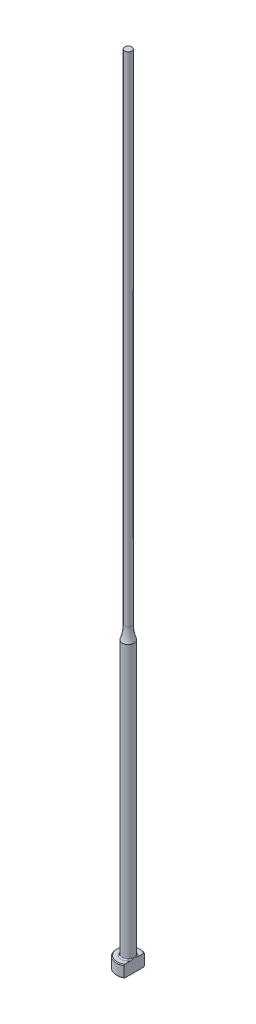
ISO-10303-21;
HEADER;
FILE_DESCRIPTION(('STEP AP214'),'2;1');
FILE_NAME('part.step','',(''),(''),'','','');
FILE_SCHEMA(('AUTOMOTIVE_DESIGN { 1 0 10303 214 1 1 1 1 }'));
ENDSEC;
DATA;
#1=APPLICATION_CONTEXT('core data for automotive mechanical design processes');
#2=APPLICATION_PROTOCOL_DEFINITION('international standard','automotive_design',2000,#1);
#3=PRODUCT_CONTEXT('',#1,'mechanical');
#4=PRODUCT('Part','Part','',(#3));
#5=PRODUCT_RELATED_PRODUCT_CATEGORY('part','',(#4));
#6=PRODUCT_DEFINITION_FORMATION('','',#4);
#7=PRODUCT_DEFINITION_CONTEXT('part definition',#1,'design');
#8=PRODUCT_DEFINITION('design','',#6,#7);
#9=PRODUCT_DEFINITION_SHAPE('','',#8);
#10=(LENGTH_UNIT() NAMED_UNIT(*) SI_UNIT(.MILLI.,.METRE.));
#11=(NAMED_UNIT(*) PLANE_ANGLE_UNIT() SI_UNIT($,.RADIAN.));
#12=(NAMED_UNIT(*) SI_UNIT($,.STERADIAN.) SOLID_ANGLE_UNIT());
#13=UNCERTAINTY_MEASURE_WITH_UNIT(LENGTH_MEASURE(1.E-05),#10,'distance_accuracy_value','');
#14=(GEOMETRIC_REPRESENTATION_CONTEXT(3) GLOBAL_UNCERTAINTY_ASSIGNED_CONTEXT((#13)) GLOBAL_UNIT_ASSIGNED_CONTEXT((#10,
#11,#12)) REPRESENTATION_CONTEXT('',''));
#15=CARTESIAN_POINT('',(0.,0.,0.));
#16=DIRECTION('',(0.,0.,1.));
#17=DIRECTION('',(1.,0.,0.));
#18=AXIS2_PLACEMENT_3D('',#15,#16,#17);
#19=CARTESIAN_POINT('',(-2.99999999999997,3.,0.));
#20=DIRECTION('',(0.,1.,0.));
#21=DIRECTION('',(0.,0.,1.));
#22=AXIS2_PLACEMENT_3D('',#19,#20,#21);
#23=PLANE('',#22);
#24=CARTESIAN_POINT('',(0.,3.,0.));
#25=DIRECTION('',(0.,1.,0.));
#26=DIRECTION('',(0.,0.,1.));
#27=AXIS2_PLACEMENT_3D('',#24,#25,#26);
#28=CIRCLE('',#27,2.79999999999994);
#29=CARTESIAN_POINT('',(1.49999999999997,3.,-2.36431808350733));
#30=VERTEX_POINT('',#29);
#31=CARTESIAN_POINT('',(1.49999999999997,3.,2.36431808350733));
#32=VERTEX_POINT('',#31);
#33=EDGE_CURVE('E187',#30,#32,#28,.T.);
#34=ORIENTED_EDGE('',*,*,#33,.T.);
#35=DIRECTION('',(0.,0.,-1.));
#36=VECTOR('',#35,1.);
#37=CARTESIAN_POINT('',(1.49999999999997,3.,0.));
#38=LINE('',#37,#36);
#39=CARTESIAN_POINT('',(1.49999999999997,3.00000000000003,0.99498743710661));
#40=VERTEX_POINT('',#39);
#41=EDGE_CURVE('E57',#32,#40,#38,.T.);
#42=ORIENTED_EDGE('',*,*,#41,.T.);
#43=CARTESIAN_POINT('',(0.,3.,0.));
#44=DIRECTION('',(0.,1.,0.));
#45=DIRECTION('',(0.,0.,1.));
#46=AXIS2_PLACEMENT_3D('',#43,#44,#45);
#47=CIRCLE('',#46,1.79999999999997);
#48=CARTESIAN_POINT('',(1.49999999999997,3.00000000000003,-0.994987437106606));
#49=VERTEX_POINT('',#48);
#50=EDGE_CURVE('E108',#40,#49,#47,.F.);
#51=ORIENTED_EDGE('',*,*,#50,.T.);
#52=EDGE_CURVE('E137',#49,#30,#38,.T.);
#53=ORIENTED_EDGE('',*,*,#52,.T.);
#54=EDGE_LOOP('',(#34,#42,#51,#53));
#55=FACE_BOUND('',#54,.T.);
#56=ADVANCED_FACE('F32',(#55),#23,.T.);
#57=CARTESIAN_POINT('',(0.,259.958771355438,0.));
#58=DIRECTION('',(0.,1.,0.));
#59=DIRECTION('',(0.,0.,1.));
#60=AXIS2_PLACEMENT_3D('',#57,#58,#59);
#61=CYLINDRICAL_SURFACE('',#60,2.99999999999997);
#62=CARTESIAN_POINT('',(0.,2.79999999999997,0.));
#63=DIRECTION('',(0.,1.,0.));
#64=DIRECTION('',(0.,0.,1.));
#65=AXIS2_PLACEMENT_3D('',#62,#63,#64);
#66=CIRCLE('',#65,2.99999999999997);
#67=CARTESIAN_POINT('',(1.49999999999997,2.79999999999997,2.5980762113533));
#68=VERTEX_POINT('',#67);
#69=CARTESIAN_POINT('',(1.49999999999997,2.79999999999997,-2.5980762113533));
#70=VERTEX_POINT('',#69);
#71=EDGE_CURVE('E105',#68,#70,#66,.F.);
#72=ORIENTED_EDGE('',*,*,#71,.T.);
#73=DIRECTION('',(0.,-1.,0.));
#74=VECTOR('',#73,1.);
#75=CARTESIAN_POINT('',(1.49999999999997,200.,-2.5980762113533));
#76=LINE('',#75,#74);
#77=CARTESIAN_POINT('',(1.49999999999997,0.200000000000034,-2.5980762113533));
#78=VERTEX_POINT('',#77);
#79=EDGE_CURVE('E193',#70,#78,#76,.T.);
#80=ORIENTED_EDGE('',*,*,#79,.T.);
#81=CARTESIAN_POINT('',(0.,0.200000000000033,0.));
#82=DIRECTION('',(0.,-1.,0.));
#83=DIRECTION('',(0.,0.,-1.));
#84=AXIS2_PLACEMENT_3D('',#81,#82,#83);
#85=CIRCLE('',#84,2.99999999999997);
#86=CARTESIAN_POINT('',(1.49999999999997,0.200000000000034,2.5980762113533));
#87=VERTEX_POINT('',#86);
#88=EDGE_CURVE('E100',#78,#87,#85,.F.);
#89=ORIENTED_EDGE('',*,*,#88,.T.);
#90=DIRECTION('',(0.,-1.,0.));
#91=VECTOR('',#90,1.);
#92=CARTESIAN_POINT('',(1.49999999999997,200.,2.5980762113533));
#93=LINE('',#92,#91);
#94=EDGE_CURVE('E93',#68,#87,#93,.T.);
#95=ORIENTED_EDGE('',*,*,#94,.F.);
#96=EDGE_LOOP('',(#72,#80,#89,#95));
#97=FACE_BOUND('',#96,.T.);
#98=ADVANCED_FACE('F158',(#97),#61,.T.);
#99=CARTESIAN_POINT('',(0.,0.,0.));
#100=DIRECTION('',(0.,-1.,0.));
#101=DIRECTION('',(0.,0.,-1.));
#102=AXIS2_PLACEMENT_3D('',#99,#100,#101);
#103=PLANE('',#102);
#104=CARTESIAN_POINT('',(0.,0.,0.));
#105=DIRECTION('',(0.,-1.,0.));
#106=DIRECTION('',(0.,0.,-1.));
#107=AXIS2_PLACEMENT_3D('',#104,#105,#106);
#108=CIRCLE('',#107,2.79999999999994);
#109=CARTESIAN_POINT('',(1.49999999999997,0.,2.36431808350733));
#110=VERTEX_POINT('',#109);
#111=CARTESIAN_POINT('',(1.49999999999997,0.,-2.36431808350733));
#112=VERTEX_POINT('',#111);
#113=EDGE_CURVE('E98',#110,#112,#108,.T.);
#114=ORIENTED_EDGE('',*,*,#113,.T.);
#115=DIRECTION('',(0.,0.,1.));
#116=VECTOR('',#115,1.);
#117=CARTESIAN_POINT('',(1.49999999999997,0.,-2.5980762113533));
#118=LINE('',#117,#116);
#119=EDGE_CURVE('E83',#112,#110,#118,.T.);
#120=ORIENTED_EDGE('',*,*,#119,.T.);
#121=EDGE_LOOP('',(#114,#120));
#122=FACE_BOUND('',#121,.T.);
#123=ADVANCED_FACE('F103',(#122),#103,.T.);
#124=CARTESIAN_POINT('',(0.,3.,0.));
#125=DIRECTION('',(0.,-1.,0.));
#126=DIRECTION('',(0.,0.,-1.));
#127=AXIS2_PLACEMENT_3D('',#124,#125,#126);
#128=CONICAL_SURFACE('',#127,2.79999999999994,0.785398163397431);
#129=ORIENTED_EDGE('',*,*,#71,.F.);
#130=CARTESIAN_POINT('',(1.49999999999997,-0.11174109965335,5.71827621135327));
#131=CARTESIAN_POINT('',(1.49999999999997,0.0136183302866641,5.58866816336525));
#132=CARTESIAN_POINT('',(1.49999999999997,0.138843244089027,5.45892957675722));
#133=CARTESIAN_POINT('',(1.49999999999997,0.388944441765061,5.19911365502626));
#134=CARTESIAN_POINT('',(1.49999999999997,0.513820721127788,5.06903631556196));
#135=CARTESIAN_POINT('',(1.49999999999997,0.763205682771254,4.80840180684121));
#136=CARTESIAN_POINT('',(1.49999999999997,0.887714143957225,4.67784442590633));
#137=CARTESIAN_POINT('',(1.49999999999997,1.13618059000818,4.4162081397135));
#138=CARTESIAN_POINT('',(1.49999999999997,1.26013857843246,4.28512923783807));
#139=CARTESIAN_POINT('',(1.49999999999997,1.50488975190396,4.02490837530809));
#140=CARTESIAN_POINT('',(1.49999999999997,1.62569693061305,3.8957795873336));
#141=CARTESIAN_POINT('',(1.49999999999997,1.86640694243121,3.63668213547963));
#142=CARTESIAN_POINT('',(1.49999999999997,1.98630978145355,3.50671347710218));
#143=CARTESIAN_POINT('',(1.49999999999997,2.2248603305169,3.24567921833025));
#144=CARTESIAN_POINT('',(1.49999999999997,2.3435083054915,3.11461386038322));
#145=CARTESIAN_POINT('',(1.49999999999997,2.5790771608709,2.85094268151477));
#146=CARTESIAN_POINT('',(1.49999999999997,2.69599811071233,2.71833692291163));
#147=CARTESIAN_POINT('',(1.49999999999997,2.88262371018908,2.50255231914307));
#148=CARTESIAN_POINT('',(1.49999999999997,2.95312454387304,2.42006293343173));
#149=CARTESIAN_POINT('',(1.49999999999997,3.09287098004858,2.25401084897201));
#150=CARTESIAN_POINT('',(1.49999999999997,3.16211645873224,2.17044804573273));
#151=CARTESIAN_POINT('',(1.49999999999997,3.29964684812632,2.00105967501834));
#152=CARTESIAN_POINT('',(1.49999999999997,3.36791386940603,1.9152195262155));
#153=CARTESIAN_POINT('',(1.49999999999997,3.50205840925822,1.7417139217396));
#154=CARTESIAN_POINT('',(1.49999999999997,3.56793649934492,1.65404891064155));
#155=CARTESIAN_POINT('',(1.49999999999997,3.69728151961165,1.47490236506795));
#156=CARTESIAN_POINT('',(1.49999999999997,3.76069661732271,1.38338308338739));
#157=CARTESIAN_POINT('',(1.49999999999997,3.88239539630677,1.19675661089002));
#158=CARTESIAN_POINT('',(1.49999999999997,3.94067201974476,1.10164473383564));
#159=CARTESIAN_POINT('',(1.49999999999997,4.048413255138,0.908008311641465));
#160=CARTESIAN_POINT('',(1.49999999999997,4.09797809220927,0.809540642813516));
#161=CARTESIAN_POINT('',(1.49999999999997,4.18432188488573,0.60719295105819));
#162=CARTESIAN_POINT('',(1.49999999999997,4.22114374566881,0.503332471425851));
#163=CARTESIAN_POINT('',(1.49999999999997,4.26099935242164,0.3475775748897));
#164=CARTESIAN_POINT('',(1.49999999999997,4.2715702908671,0.297609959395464));
#165=CARTESIAN_POINT('',(1.49999999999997,4.28794860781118,0.196885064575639));
#166=CARTESIAN_POINT('',(1.49999999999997,4.29375640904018,0.146127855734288));
#167=CARTESIAN_POINT('',(1.49999999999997,4.30019707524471,0.0444388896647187));
#168=CARTESIAN_POINT('',(1.49999999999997,4.30084594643,-0.00649183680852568));
#169=CARTESIAN_POINT('',(1.49999999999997,4.29696416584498,-0.108155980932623));
#170=CARTESIAN_POINT('',(1.49999999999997,4.29243308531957,-0.158889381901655));
#171=CARTESIAN_POINT('',(1.49999999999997,4.27856915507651,-0.259234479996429));
#172=CARTESIAN_POINT('',(1.49999999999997,4.2692782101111,-0.308852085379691));
#173=CARTESIAN_POINT('',(1.49999999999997,4.24647108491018,-0.407110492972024));
#174=CARTESIAN_POINT('',(1.49999999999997,4.23295324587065,-0.45575090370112));
#175=CARTESIAN_POINT('',(1.49999999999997,4.20226175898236,-0.55214996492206));
#176=CARTESIAN_POINT('',(1.49999999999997,4.18506801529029,-0.599902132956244));
#177=CARTESIAN_POINT('',(1.49999999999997,4.14771387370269,-0.694205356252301));
#178=CARTESIAN_POINT('',(1.49999999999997,4.12755408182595,-0.740756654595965));
#179=CARTESIAN_POINT('',(1.49999999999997,4.0632769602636,-0.879166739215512));
#180=CARTESIAN_POINT('',(1.49999999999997,4.01551721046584,-0.969329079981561));
#181=CARTESIAN_POINT('',(1.49999999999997,3.91367909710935,-1.14604316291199));
#182=CARTESIAN_POINT('',(1.49999999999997,3.85959300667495,-1.2325903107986));
#183=CARTESIAN_POINT('',(1.49999999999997,3.74697968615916,-1.40321348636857));
#184=CARTESIAN_POINT('',(1.49999999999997,3.68843573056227,-1.4872783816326));
#185=CARTESIAN_POINT('',(1.49999999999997,3.5684384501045,-1.65322187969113));
#186=CARTESIAN_POINT('',(1.49999999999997,3.50698656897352,-1.73510153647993));
#187=CARTESIAN_POINT('',(1.49999999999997,3.3811567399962,-1.89829823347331));
#188=CARTESIAN_POINT('',(1.49999999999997,3.31675092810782,-1.97959369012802));
#189=CARTESIAN_POINT('',(1.49999999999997,3.18634068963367,-2.14090082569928));
#190=CARTESIAN_POINT('',(1.49999999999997,3.12033609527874,-2.22091236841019));
#191=CARTESIAN_POINT('',(1.49999999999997,2.92086431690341,-2.45906508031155));
#192=CARTESIAN_POINT('',(1.49999999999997,2.78562663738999,-2.61572090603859));
#193=CARTESIAN_POINT('',(1.49999999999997,2.53554498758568,-2.90006295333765));
#194=CARTESIAN_POINT('',(1.49999999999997,2.42114543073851,-3.02814382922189));
#195=CARTESIAN_POINT('',(1.49999999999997,2.1909355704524,-3.28303767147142));
#196=CARTESIAN_POINT('',(1.49999999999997,2.07512522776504,-3.40985060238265));
#197=CARTESIAN_POINT('',(1.49999999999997,1.72597067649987,-3.78913849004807));
#198=CARTESIAN_POINT('',(1.49999999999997,1.49111760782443,-4.04022177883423));
#199=CARTESIAN_POINT('',(1.49999999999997,1.0288247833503,-4.52992803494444));
#200=CARTESIAN_POINT('',(1.49999999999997,0.801477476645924,-4.76863870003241));
#201=CARTESIAN_POINT('',(1.49999999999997,0.459548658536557,-5.12558036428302));
#202=CARTESIAN_POINT('',(1.49999999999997,0.345484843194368,-5.24430773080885));
#203=CARTESIAN_POINT('',(1.49999999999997,0.117071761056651,-5.48148573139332));
#204=CARTESIAN_POINT('',(1.49999999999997,0.00272249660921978,-5.59993636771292));
#205=CARTESIAN_POINT('',(1.49999999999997,-0.11174109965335,-5.71827621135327));
#206=B_SPLINE_CURVE_WITH_KNOTS('',3,(#130,#131,#132,#133,#134,#135,#136,#137,#138,#139,#140,
#141,#142,#143,#144,#145,#146,#147,#148,#149,#150,#151,#152,#153,#154,#155,#156,#157,#158,#159,
#160,#161,#162,#163,#164,#165,#166,#167,#168,#169,#170,#171,#172,#173,#174,#175,#176,#177,#178,
#179,#180,#181,#182,#183,#184,#185,#186,#187,#188,#189,#190,#191,#192,#193,#194,#195,#196,#197,
#198,#199,#200,#201,#202,#203,#204,#205),.UNSPECIFIED.,.F.,.F.,(4,2,2,2,2,2,2,2,2,2,2,2,2,2,2,2,
2,2,2,2,2,2,2,2,2,2,2,2,2,2,2,2,2,2,2,2,2,4),(0.,0.540943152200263,1.08189327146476,
1.62312052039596,2.16434426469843,2.69482920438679,3.22531067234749,3.75567781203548,
4.28602356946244,4.61155053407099,4.9371094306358,5.26610945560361,5.59503024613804,
5.92894782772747,6.26331713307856,6.59354403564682,6.92264800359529,7.07567478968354,
7.2286879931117,7.38122626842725,7.53377717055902,7.6850075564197,7.83629736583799,
7.98843643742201,8.14054446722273,8.44618799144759,8.75220879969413,9.05944044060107,
9.3665211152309,9.6776428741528,9.98879742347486,10.609592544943,11.1247803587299,
11.6399825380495,12.6713544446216,13.6603005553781,14.1542238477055,14.6481430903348),.UNSPECIFIED.);
#207=EDGE_CURVE('E136',#68,#32,#206,.T.);
#208=ORIENTED_EDGE('',*,*,#207,.T.);
#209=ORIENTED_EDGE('',*,*,#33,.F.);
#210=EDGE_CURVE('E128',#30,#70,#206,.T.);
#211=ORIENTED_EDGE('',*,*,#210,.T.);
#212=EDGE_LOOP('',(#129,#208,#209,#211));
#213=FACE_BOUND('',#212,.T.);
#214=ADVANCED_FACE('F144',(#213),#128,.T.);
#215=CARTESIAN_POINT('',(0.,0.200000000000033,0.));
#216=DIRECTION('',(0.,1.,0.));
#217=DIRECTION('',(0.,0.,1.));
#218=AXIS2_PLACEMENT_3D('',#215,#216,#217);
#219=CONICAL_SURFACE('',#218,2.99999999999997,0.785398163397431);
#220=ORIENTED_EDGE('',*,*,#88,.F.);
#221=CARTESIAN_POINT('',(1.49999999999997,3.11174109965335,-5.71827621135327));
#222=CARTESIAN_POINT('',(1.49999999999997,2.98638166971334,-5.58866816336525));
#223=CARTESIAN_POINT('',(1.49999999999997,2.86115675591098,-5.45892957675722));
#224=CARTESIAN_POINT('',(1.49999999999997,2.61105555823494,-5.19911365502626));
#225=CARTESIAN_POINT('',(1.49999999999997,2.48617927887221,-5.06903631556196));
#226=CARTESIAN_POINT('',(1.49999999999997,2.23679431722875,-4.80840180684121));
#227=CARTESIAN_POINT('',(1.49999999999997,2.11228585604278,-4.67784442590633));
#228=CARTESIAN_POINT('',(1.49999999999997,1.86381940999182,-4.4162081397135));
#229=CARTESIAN_POINT('',(1.49999999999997,1.73986142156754,-4.28512923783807));
#230=CARTESIAN_POINT('',(1.49999999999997,1.49511024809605,-4.02490837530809));
#231=CARTESIAN_POINT('',(1.49999999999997,1.37430306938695,-3.8957795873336));
#232=CARTESIAN_POINT('',(1.49999999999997,1.13359305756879,-3.63668213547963));
#233=CARTESIAN_POINT('',(1.49999999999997,1.01369021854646,-3.50671347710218));
#234=CARTESIAN_POINT('',(1.49999999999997,0.775139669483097,-3.24567921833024));
#235=CARTESIAN_POINT('',(1.49999999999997,0.656491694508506,-3.11461386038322));
#236=CARTESIAN_POINT('',(1.49999999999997,0.420922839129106,-2.85094268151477));
#237=CARTESIAN_POINT('',(1.49999999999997,0.304001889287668,-2.71833692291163));
#238=CARTESIAN_POINT('',(1.49999999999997,0.117376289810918,-2.50255231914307));
#239=CARTESIAN_POINT('',(1.49999999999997,0.0468754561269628,-2.42006293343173));
#240=CARTESIAN_POINT('',(1.49999999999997,-0.0928709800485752,-2.254010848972));
#241=CARTESIAN_POINT('',(1.49999999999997,-0.162116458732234,-2.17044804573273));
#242=CARTESIAN_POINT('',(1.49999999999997,-0.299646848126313,-2.00105967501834));
#243=CARTESIAN_POINT('',(1.49999999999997,-0.367913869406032,-1.9152195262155));
#244=CARTESIAN_POINT('',(1.49999999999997,-0.502058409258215,-1.7417139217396));
#245=CARTESIAN_POINT('',(1.49999999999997,-0.567936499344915,-1.65404891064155));
#246=CARTESIAN_POINT('',(1.49999999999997,-0.697281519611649,-1.47490236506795));
#247=CARTESIAN_POINT('',(1.49999999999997,-0.760696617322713,-1.38338308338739));
#248=CARTESIAN_POINT('',(1.49999999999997,-0.882395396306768,-1.19675661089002));
#249=CARTESIAN_POINT('',(1.49999999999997,-0.940672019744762,-1.10164473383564));
#250=CARTESIAN_POINT('',(1.49999999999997,-1.04841325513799,-0.908008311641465));
#251=CARTESIAN_POINT('',(1.49999999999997,-1.09797809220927,-0.809540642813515));
#252=CARTESIAN_POINT('',(1.49999999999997,-1.18432188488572,-0.607192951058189));
#253=CARTESIAN_POINT('',(1.49999999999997,-1.22114374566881,-0.503332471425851));
#254=CARTESIAN_POINT('',(1.49999999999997,-1.26099935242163,-0.3475775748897));
#255=CARTESIAN_POINT('',(1.49999999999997,-1.2715702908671,-0.297609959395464));
#256=CARTESIAN_POINT('',(1.49999999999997,-1.28794860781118,-0.19688506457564));
#257=CARTESIAN_POINT('',(1.49999999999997,-1.29375640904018,-0.146127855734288));
#258=CARTESIAN_POINT('',(1.49999999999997,-1.30019707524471,-0.0444388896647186));
#259=CARTESIAN_POINT('',(1.49999999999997,-1.30084594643,0.00649183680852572));
#260=CARTESIAN_POINT('',(1.49999999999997,-1.29696416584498,0.108155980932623));
#261=CARTESIAN_POINT('',(1.49999999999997,-1.29243308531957,0.158889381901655));
#262=CARTESIAN_POINT('',(1.49999999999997,-1.2785691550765,0.259234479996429));
#263=CARTESIAN_POINT('',(1.49999999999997,-1.2692782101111,0.308852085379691));
#264=CARTESIAN_POINT('',(1.49999999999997,-1.24647108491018,0.407110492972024));
#265=CARTESIAN_POINT('',(1.49999999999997,-1.23295324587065,0.45575090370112));
#266=CARTESIAN_POINT('',(1.49999999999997,-1.20226175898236,0.55214996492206));
#267=CARTESIAN_POINT('',(1.49999999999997,-1.18506801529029,0.599902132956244));
#268=CARTESIAN_POINT('',(1.49999999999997,-1.14771387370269,0.694205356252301));
#269=CARTESIAN_POINT('',(1.49999999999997,-1.12755408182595,0.740756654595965));
#270=CARTESIAN_POINT('',(1.49999999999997,-1.0632769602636,0.879166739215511));
#271=CARTESIAN_POINT('',(1.49999999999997,-1.01551721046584,0.96932907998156));
#272=CARTESIAN_POINT('',(1.49999999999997,-0.913679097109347,1.14604316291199));
#273=CARTESIAN_POINT('',(1.49999999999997,-0.85959300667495,1.2325903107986));
#274=CARTESIAN_POINT('',(1.49999999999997,-0.74697968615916,1.40321348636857));
#275=CARTESIAN_POINT('',(1.49999999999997,-0.688435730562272,1.4872783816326));
#276=CARTESIAN_POINT('',(1.49999999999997,-0.568438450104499,1.65322187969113));
#277=CARTESIAN_POINT('',(1.49999999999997,-0.50698656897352,1.73510153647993));
#278=CARTESIAN_POINT('',(1.49999999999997,-0.381156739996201,1.89829823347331));
#279=CARTESIAN_POINT('',(1.49999999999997,-0.316750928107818,1.97959369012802));
#280=CARTESIAN_POINT('',(1.49999999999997,-0.186340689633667,2.14090082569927));
#281=CARTESIAN_POINT('',(1.49999999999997,-0.120336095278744,2.22091236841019));
#282=CARTESIAN_POINT('',(1.49999999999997,0.0791356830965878,2.45906508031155));
#283=CARTESIAN_POINT('',(1.49999999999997,0.214373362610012,2.61572090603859));
#284=CARTESIAN_POINT('',(1.49999999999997,0.464455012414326,2.90006295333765));
#285=CARTESIAN_POINT('',(1.49999999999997,0.578854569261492,3.02814382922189));
#286=CARTESIAN_POINT('',(1.49999999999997,0.809064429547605,3.28303767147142));
#287=CARTESIAN_POINT('',(1.49999999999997,0.924874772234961,3.40985060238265));
#288=CARTESIAN_POINT('',(1.49999999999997,1.27402932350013,3.78913849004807));
#289=CARTESIAN_POINT('',(1.49999999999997,1.50888239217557,4.04022177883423));
#290=CARTESIAN_POINT('',(1.49999999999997,1.97117521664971,4.52992803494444));
#291=CARTESIAN_POINT('',(1.49999999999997,2.19852252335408,4.76863870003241));
#292=CARTESIAN_POINT('',(1.49999999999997,2.54045134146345,5.12558036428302));
#293=CARTESIAN_POINT('',(1.49999999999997,2.65451515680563,5.24430773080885));
#294=CARTESIAN_POINT('',(1.49999999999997,2.88292823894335,5.48148573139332));
#295=CARTESIAN_POINT('',(1.49999999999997,2.99727750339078,5.59993636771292));
#296=CARTESIAN_POINT('',(1.49999999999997,3.11174109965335,5.71827621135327));
#297=B_SPLINE_CURVE_WITH_KNOTS('',3,(#221,#222,#223,#224,#225,#226,#227,#228,#229,#230,#231,
#232,#233,#234,#235,#236,#237,#238,#239,#240,#241,#242,#243,#244,#245,#246,#247,#248,#249,#250,
#251,#252,#253,#254,#255,#256,#257,#258,#259,#260,#261,#262,#263,#264,#265,#266,#267,#268,#269,
#270,#271,#272,#273,#274,#275,#276,#277,#278,#279,#280,#281,#282,#283,#284,#285,#286,#287,#288,
#289,#290,#291,#292,#293,#294,#295,#296),.UNSPECIFIED.,.F.,.F.,(4,2,2,2,2,2,2,2,2,2,2,2,2,2,2,2,
2,2,2,2,2,2,2,2,2,2,2,2,2,2,2,2,2,2,2,2,2,4),(0.,0.540943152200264,1.08189327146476,
1.62312052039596,2.16434426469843,2.69482920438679,3.22531067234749,3.75567781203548,
4.28602356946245,4.611550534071,4.9371094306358,5.26610945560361,5.59503024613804,
5.92894782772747,6.26331713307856,6.59354403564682,6.92264800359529,7.07567478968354,
7.2286879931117,7.38122626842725,7.53377717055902,7.6850075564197,7.83629736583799,
7.98843643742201,8.14054446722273,8.44618799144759,8.75220879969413,9.05944044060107,
9.3665211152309,9.6776428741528,9.98879742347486,10.609592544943,11.1247803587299,
11.6399825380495,12.6713544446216,13.6603005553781,14.1542238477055,14.6481430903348),.UNSPECIFIED.);
#298=EDGE_CURVE('E86',#78,#112,#297,.T.);
#299=ORIENTED_EDGE('',*,*,#298,.T.);
#300=ORIENTED_EDGE('',*,*,#113,.F.);
#301=EDGE_CURVE('E89',#110,#87,#297,.T.);
#302=ORIENTED_EDGE('',*,*,#301,.T.);
#303=EDGE_LOOP('',(#220,#299,#300,#302));
#304=FACE_BOUND('',#303,.T.);
#305=ADVANCED_FACE('F97',(#304),#219,.T.);
#306=CARTESIAN_POINT('',(0.,3.30000000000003,0.));
#307=DIRECTION('',(0.,1.,0.));
#308=DIRECTION('',(0.,0.,1.));
#309=AXIS2_PLACEMENT_3D('',#306,#307,#308);
#310=TOROIDAL_SURFACE('',#309,1.79999999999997,0.3);
#311=CARTESIAN_POINT('',(1.49999999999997,3.30000000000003,0.));
#312=CARTESIAN_POINT('',(1.49999999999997,3.300000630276,3.41555678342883E-12));
#313=CARTESIAN_POINT('',(1.49999999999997,3.30000126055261,-1.15373640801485E-07));
#314=CARTESIAN_POINT('',(1.49999999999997,3.3000024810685,-4.90631575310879E-07));
#315=CARTESIAN_POINT('',(1.49999999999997,3.30000307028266,-7.53296670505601E-07));
#316=CARTESIAN_POINT('',(1.49999999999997,3.30000424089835,-1.38757096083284E-06));
#317=CARTESIAN_POINT('',(1.49999999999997,3.300004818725,-1.76563001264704E-06));
#318=CARTESIAN_POINT('',(1.49999999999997,3.30000591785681,-2.58768006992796E-06));
#319=CARTESIAN_POINT('',(1.49999999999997,3.30000643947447,-3.03127014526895E-06));
#320=CARTESIAN_POINT('',(1.49999999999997,3.30000815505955,-4.60021967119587E-06));
#321=CARTESIAN_POINT('',(1.49999999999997,3.30000927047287,-5.8124152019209E-06));
#322=CARTESIAN_POINT('',(1.49999999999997,3.30001128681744,-8.33989413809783E-06));
#323=CARTESIAN_POINT('',(1.49999999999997,3.30001219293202,-9.65128157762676E-06));
#324=CARTESIAN_POINT('',(1.49999999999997,3.30001551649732,-1.46782505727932E-05));
#325=CARTESIAN_POINT('',(1.49999999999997,3.30001775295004,-1.8517976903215E-05));
#326=CARTESIAN_POINT('',(1.49999999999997,3.30002148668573,-2.61616194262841E-05));
#327=CARTESIAN_POINT('',(1.49999999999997,3.30002302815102,-2.99447742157E-05));
#328=CARTESIAN_POINT('',(1.49999999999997,3.30002943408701,-4.58003743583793E-05));
#329=CARTESIAN_POINT('',(1.49999999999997,3.3000341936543,-5.79079078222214E-05));
#330=CARTESIAN_POINT('',(1.49999999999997,3.30004197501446,-8.07263755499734E-05));
#331=CARTESIAN_POINT('',(1.49999999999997,3.30004514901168,-9.13834709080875E-05));
#332=CARTESIAN_POINT('',(1.49999999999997,3.30006989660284,-0.000167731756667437));
#333=CARTESIAN_POINT('',(1.49999999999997,3.30010092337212,-0.000229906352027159));
#334=CARTESIAN_POINT('',(1.49999999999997,3.30021632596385,-0.000470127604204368));
#335=CARTESIAN_POINT('',(1.49999999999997,3.30029368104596,-0.000650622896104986));
#336=CARTESIAN_POINT('',(1.49999999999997,3.30059619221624,-0.00134589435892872));
#337=CARTESIAN_POINT('',(1.49999999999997,3.30082870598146,-0.00185814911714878));
#338=CARTESIAN_POINT('',(1.49999999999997,3.30176696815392,-0.00393547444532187));
#339=CARTESIAN_POINT('',(1.49999999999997,3.30246445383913,-0.00550332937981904));
#340=CARTESIAN_POINT('',(1.49999999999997,3.31426785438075,-0.0320229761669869));
#341=CARTESIAN_POINT('',(1.49999999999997,3.32544800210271,-0.0569503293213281));
#342=CARTESIAN_POINT('',(1.49999999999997,3.34725700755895,-0.105984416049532));
#343=CARTESIAN_POINT('',(1.49999999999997,3.35789134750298,-0.130088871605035));
#344=CARTESIAN_POINT('',(1.49999999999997,3.38015321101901,-0.181096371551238));
#345=CARTESIAN_POINT('',(1.49999999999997,3.39175804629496,-0.208009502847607));
#346=CARTESIAN_POINT('',(1.49999999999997,3.41469034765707,-0.262264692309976));
#347=CARTESIAN_POINT('',(1.49999999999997,3.42601398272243,-0.289608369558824));
#348=CARTESIAN_POINT('',(1.49999999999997,3.45363212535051,-0.35820378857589));
#349=CARTESIAN_POINT('',(1.49999999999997,3.46959026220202,-0.39959288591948));
#350=CARTESIAN_POINT('',(1.49999999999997,3.49940505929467,-0.482097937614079));
#351=CARTESIAN_POINT('',(1.49999999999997,3.51330033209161,-0.523199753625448));
#352=CARTESIAN_POINT('',(1.49999999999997,3.53552507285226,-0.595497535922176));
#353=CARTESIAN_POINT('',(1.49999999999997,3.54436834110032,-0.626532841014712));
#354=CARTESIAN_POINT('',(1.49999999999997,3.56052427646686,-0.6891760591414));
#355=CARTESIAN_POINT('',(1.49999999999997,3.5678279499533,-0.720786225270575));
#356=CARTESIAN_POINT('',(1.49999999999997,3.5875075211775,-0.819524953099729));
#357=CARTESIAN_POINT('',(1.49999999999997,3.59661044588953,-0.88742909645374));
#358=CARTESIAN_POINT('',(1.49999999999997,3.60059842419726,-0.991180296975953));
#359=CARTESIAN_POINT('',(1.49999999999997,3.60019840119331,-1.02684364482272));
#360=CARTESIAN_POINT('',(1.49999999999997,3.59497085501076,-1.097505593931));
#361=CARTESIAN_POINT('',(1.49999999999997,3.59019295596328,-1.13250716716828));
#362=CARTESIAN_POINT('',(1.49999999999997,3.57687734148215,-1.19353096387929));
#363=CARTESIAN_POINT('',(1.49999999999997,3.56943875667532,-1.21978854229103));
#364=CARTESIAN_POINT('',(1.49999999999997,3.55063748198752,-1.27094658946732));
#365=CARTESIAN_POINT('',(1.49999999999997,3.53927342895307,-1.29584658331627));
#366=CARTESIAN_POINT('',(1.49999999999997,3.51660016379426,-1.33501873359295));
#367=CARTESIAN_POINT('',(1.49999999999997,3.50657738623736,-1.35003296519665));
#368=CARTESIAN_POINT('',(1.49999999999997,3.48437469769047,-1.37837252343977));
#369=CARTESIAN_POINT('',(1.49999999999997,3.47219867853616,-1.39170082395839));
#370=CARTESIAN_POINT('',(1.49999999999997,3.44835614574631,-1.41349417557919));
#371=CARTESIAN_POINT('',(1.49999999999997,3.43709185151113,-1.42239673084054));
#372=CARTESIAN_POINT('',(1.49999999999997,3.41325256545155,-1.43825467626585));
#373=CARTESIAN_POINT('',(1.49999999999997,3.40067804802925,-1.44521076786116));
#374=CARTESIAN_POINT('',(1.49999999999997,3.37433767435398,-1.45677158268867));
#375=CARTESIAN_POINT('',(1.49999999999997,3.36056203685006,-1.46135438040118));
#376=CARTESIAN_POINT('',(1.49999999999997,3.33237324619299,-1.46767730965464));
#377=CARTESIAN_POINT('',(1.49999999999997,3.31796076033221,-1.46942034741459));
#378=CARTESIAN_POINT('',(1.49999999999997,3.29122479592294,-1.4698720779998));
#379=CARTESIAN_POINT('',(1.49999999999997,3.27890664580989,-1.468990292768));
#380=CARTESIAN_POINT('',(1.49999999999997,3.25461019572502,-1.4651157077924));
#381=CARTESIAN_POINT('',(1.49999999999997,3.2426318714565,-1.46212305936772));
#382=CARTESIAN_POINT('',(1.49999999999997,3.21959683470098,-1.4543117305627));
#383=CARTESIAN_POINT('',(1.49999999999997,3.20852542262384,-1.44953579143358));
#384=CARTESIAN_POINT('',(1.49999999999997,3.18721125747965,-1.43840957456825));
#385=CARTESIAN_POINT('',(1.49999999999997,3.1769687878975,-1.43205876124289));
#386=CARTESIAN_POINT('',(1.49999999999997,3.15325976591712,-1.41506353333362));
#387=CARTESIAN_POINT('',(1.49999999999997,3.14027750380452,-1.40374235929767));
#388=CARTESIAN_POINT('',(1.49999999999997,3.11630720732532,-1.37914825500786));
#389=CARTESIAN_POINT('',(1.49999999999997,3.10532420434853,-1.36587054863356));
#390=CARTESIAN_POINT('',(1.49999999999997,3.08100891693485,-1.33197272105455));
#391=CARTESIAN_POINT('',(1.49999999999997,3.06867625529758,-1.31063843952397));
#392=CARTESIAN_POINT('',(1.49999999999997,3.04751867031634,-1.26637455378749));
#393=CARTESIAN_POINT('',(1.49999999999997,3.03869240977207,-1.24344556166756));
#394=CARTESIAN_POINT('',(1.49999999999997,3.01978360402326,-1.18316534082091));
#395=CARTESIAN_POINT('',(1.49999999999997,3.01191472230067,-1.14512623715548));
#396=CARTESIAN_POINT('',(1.49999999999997,3.00188285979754,-1.06789971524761));
#397=CARTESIAN_POINT('',(1.49999999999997,2.99979735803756,-1.02870374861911));
#398=CARTESIAN_POINT('',(1.49999999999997,3.00021727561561,-0.953160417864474));
#399=CARTESIAN_POINT('',(1.49999999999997,3.00240673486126,-0.916808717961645));
#400=CARTESIAN_POINT('',(1.49999999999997,3.0099643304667,-0.844432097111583));
#401=CARTESIAN_POINT('',(1.49999999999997,3.01533462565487,-0.808407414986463));
#402=CARTESIAN_POINT('',(1.49999999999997,3.02828086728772,-0.738670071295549));
#403=CARTESIAN_POINT('',(1.49999999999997,3.03573028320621,-0.704933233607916));
#404=CARTESIAN_POINT('',(1.49999999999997,3.05243174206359,-0.638128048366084));
#405=CARTESIAN_POINT('',(1.49999999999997,3.06167285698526,-0.605056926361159));
#406=CARTESIAN_POINT('',(1.49999999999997,3.08440652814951,-0.53019513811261));
#407=CARTESIAN_POINT('',(1.49999999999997,3.09836576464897,-0.488547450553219));
#408=CARTESIAN_POINT('',(1.49999999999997,3.1283820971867,-0.404954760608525));
#409=CARTESIAN_POINT('',(1.49999999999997,3.14447968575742,-0.363024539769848));
#410=CARTESIAN_POINT('',(1.49999999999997,3.17238454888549,-0.293508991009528));
#411=CARTESIAN_POINT('',(1.49999999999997,3.18384249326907,-0.265781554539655));
#412=CARTESIAN_POINT('',(1.49999999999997,3.20705854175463,-0.210769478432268));
#413=CARTESIAN_POINT('',(1.49999999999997,3.21881265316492,-0.183483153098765));
#414=CARTESIAN_POINT('',(1.49999999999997,3.24136702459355,-0.131772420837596));
#415=CARTESIAN_POINT('',(1.49999999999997,3.25214361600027,-0.107337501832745));
#416=CARTESIAN_POINT('',(1.49999999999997,3.27424746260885,-0.0576321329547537));
#417=CARTESIAN_POINT('',(1.49999999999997,3.28558038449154,-0.0323640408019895));
#418=CARTESIAN_POINT('',(1.49999999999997,3.29753556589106,-0.00550327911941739));
#419=CARTESIAN_POINT('',(1.49999999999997,3.29823307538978,-0.00393537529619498));
#420=CARTESIAN_POINT('',(1.49999999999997,3.29917134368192,-0.00185803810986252));
#421=CARTESIAN_POINT('',(1.49999999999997,3.29940384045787,-0.00134582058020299));
#422=CARTESIAN_POINT('',(1.49999999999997,3.29970633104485,-0.000650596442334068));
#423=CARTESIAN_POINT('',(1.49999999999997,3.29978368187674,-0.000470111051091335));
#424=CARTESIAN_POINT('',(1.49999999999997,3.29989907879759,-0.000229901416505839));
#425=CARTESIAN_POINT('',(1.49999999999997,3.29993010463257,-0.000167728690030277));
#426=CARTESIAN_POINT('',(1.49999999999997,3.29995485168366,-9.13825689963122E-05));
#427=CARTESIAN_POINT('',(1.49999999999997,3.29995802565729,-8.07256241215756E-05));
#428=CARTESIAN_POINT('',(1.49999999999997,3.29996580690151,-5.79074820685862E-05));
#429=CARTESIAN_POINT('',(1.49999999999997,3.29997056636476,-4.5800119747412E-05));
#430=CARTESIAN_POINT('',(1.49999999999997,3.29997697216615,-2.99447119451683E-05));
#431=CARTESIAN_POINT('',(1.49999999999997,3.2999785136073,-2.61615817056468E-05));
#432=CARTESIAN_POINT('',(1.49999999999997,3.2999822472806,-1.85179845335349E-05));
#433=CARTESIAN_POINT('',(1.49999999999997,3.29998448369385,-1.46782782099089E-05));
#434=CARTESIAN_POINT('',(1.49999999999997,3.2999878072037,-9.65132752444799E-06));
#435=CARTESIAN_POINT('',(1.49999999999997,3.299988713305,-8.33994202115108E-06));
#436=CARTESIAN_POINT('',(1.49999999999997,3.29999072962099,-5.81246426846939E-06));
#437=CARTESIAN_POINT('',(1.49999999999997,3.29999184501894,-4.600267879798E-06));
#438=CARTESIAN_POINT('',(1.49999999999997,3.29999356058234,-3.03131394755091E-06));
#439=CARTESIAN_POINT('',(1.49999999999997,3.29999408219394,-2.58772196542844E-06));
#440=CARTESIAN_POINT('',(1.49999999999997,3.2999951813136,-1.76566701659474E-06));
#441=CARTESIAN_POINT('',(1.49999999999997,3.29999575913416,-1.38760497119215E-06));
#442=CARTESIAN_POINT('',(1.49999999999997,3.29999692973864,-7.53323425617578E-07));
#443=CARTESIAN_POINT('',(1.49999999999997,3.29999751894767,-4.90654189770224E-07));
#444=CARTESIAN_POINT('',(1.49999999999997,3.29999873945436,-1.15386267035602E-07));
#445=CARTESIAN_POINT('',(1.49999999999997,3.29999936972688,-3.41554144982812E-12));
#446=CARTESIAN_POINT('',(1.49999999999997,3.30000000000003,0.));
#447=B_SPLINE_CURVE_WITH_KNOTS('',3,(#311,#312,#313,#314,#315,#316,#317,#318,#319,#320,#321,
#322,#323,#324,#325,#326,#327,#328,#329,#330,#331,#332,#333,#334,#335,#336,#337,#338,#339,#340,
#341,#342,#343,#344,#345,#346,#347,#348,#349,#350,#351,#352,#353,#354,#355,#356,#357,#358,#359,
#360,#361,#362,#363,#364,#365,#366,#367,#368,#369,#370,#371,#372,#373,#374,#375,#376,#377,#378,
#379,#380,#381,#382,#383,#384,#385,#386,#387,#388,#389,#390,#391,#392,#393,#394,#395,#396,#397,
#398,#399,#400,#401,#402,#403,#404,#405,#406,#407,#408,#409,#410,#411,#412,#413,#414,#415,#416,
#417,#418,#419,#420,#421,#422,#423,#424,#425,#426,#427,#428,#429,#430,#431,#432,#433,#434,#435,
#436,#437,#438,#439,#440,#441,#442,#443,#444,#445,#446),.UNSPECIFIED.,.T.,.F.,(4,2,2,2,2,2,2,2,
2,2,2,2,2,2,2,2,2,2,2,2,2,2,2,2,2,2,2,2,2,2,2,2,2,2,2,2,2,2,2,2,2,2,2,2,2,2,2,2,2,2,2,2,2,2,2,2,
2,2,2,2,2,2,2,2,2,2,2,4),(0.,1.88906036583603E-06,3.8150959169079E-06,5.87892837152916E-06,
7.93062024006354E-06,1.28480890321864E-05,1.76261717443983E-05,3.0909918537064E-05,
4.31529750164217E-05,8.21699329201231E-05,0.000115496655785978,0.000323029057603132,
0.000912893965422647,0.00259963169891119,0.00774858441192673,0.0896975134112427,
0.168737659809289,0.256660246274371,0.345444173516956,0.478492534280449,0.608603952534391,
0.705372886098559,0.802692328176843,1.00719557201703,1.11399616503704,1.21960092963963,
1.30124317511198,1.38291380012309,1.43690814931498,1.49080588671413,1.53371524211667,
1.57660911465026,1.61989249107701,1.66313154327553,1.69999492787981,1.73685567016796,
1.77288440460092,1.80892540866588,1.86031324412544,1.91182866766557,1.98534297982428,
2.05882922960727,2.1747172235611,2.29215041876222,2.40123170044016,2.51038710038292,
2.613972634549,2.71694519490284,2.84866234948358,2.98337525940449,3.07337666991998,
3.16250453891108,3.24262397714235,3.32569301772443,3.3308421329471,3.33252874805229,
3.33311858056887,3.33332610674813,3.33335943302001,3.33339844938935,3.3334106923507,
3.33342397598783,3.33342875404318,3.33343367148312,3.33343572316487,3.33343778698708,
3.33343971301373,3.33344160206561),.UNSPECIFIED.);
#448=CARTESIAN_POINT('',(1.49999999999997,3.30000000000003,0.));
#449=VERTEX_POINT('',#448);
#450=EDGE_CURVE('E11',#49,#449,#447,.T.);
#451=ORIENTED_EDGE('',*,*,#450,.F.);
#452=ORIENTED_EDGE('',*,*,#50,.F.);
#453=CARTESIAN_POINT('',(1.49999999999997,3.30000000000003,0.));
#454=CARTESIAN_POINT('',(1.49999999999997,3.29999936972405,-3.41547770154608E-12));
#455=CARTESIAN_POINT('',(1.49999999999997,3.29999873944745,1.15373640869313E-07));
#456=CARTESIAN_POINT('',(1.49999999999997,3.29999751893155,4.90631575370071E-07));
#457=CARTESIAN_POINT('',(1.49999999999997,3.29999692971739,7.53296670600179E-07));
#458=CARTESIAN_POINT('',(1.49999999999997,3.2999957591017,1.38757096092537E-06));
#459=CARTESIAN_POINT('',(1.49999999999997,3.29999518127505,1.76563001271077E-06));
#460=CARTESIAN_POINT('',(1.49999999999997,3.29999408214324,2.58768007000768E-06));
#461=CARTESIAN_POINT('',(1.49999999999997,3.29999356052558,3.03127014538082E-06));
#462=CARTESIAN_POINT('',(1.49999999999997,3.2999918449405,4.60021967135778E-06));
#463=CARTESIAN_POINT('',(1.49999999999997,3.29999072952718,5.81241520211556E-06));
#464=CARTESIAN_POINT('',(1.49999999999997,3.29998871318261,8.33989413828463E-06));
#465=CARTESIAN_POINT('',(1.49999999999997,3.29998780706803,9.65128157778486E-06));
#466=CARTESIAN_POINT('',(1.49999999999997,3.29998448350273,1.46782505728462E-05));
#467=CARTESIAN_POINT('',(1.49999999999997,3.29998224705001,1.85179769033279E-05));
#468=CARTESIAN_POINT('',(1.49999999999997,3.29997851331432,2.61616194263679E-05));
#469=CARTESIAN_POINT('',(1.49999999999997,3.29997697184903,2.99447742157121E-05));
#470=CARTESIAN_POINT('',(1.49999999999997,3.29997056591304,4.58003743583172E-05));
#471=CARTESIAN_POINT('',(1.49999999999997,3.29996580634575,5.79079078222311E-05));
#472=CARTESIAN_POINT('',(1.49999999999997,3.29995802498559,8.07263755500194E-05));
#473=CARTESIAN_POINT('',(1.49999999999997,3.29995485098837,9.1383470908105E-05));
#474=CARTESIAN_POINT('',(1.49999999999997,3.29993010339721,0.000167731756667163));
#475=CARTESIAN_POINT('',(1.49999999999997,3.29989907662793,0.000229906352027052));
#476=CARTESIAN_POINT('',(1.49999999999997,3.2997836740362,0.000470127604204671));
#477=CARTESIAN_POINT('',(1.49999999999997,3.2997063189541,0.000650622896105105));
#478=CARTESIAN_POINT('',(1.49999999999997,3.29940380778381,0.00134589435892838));
#479=CARTESIAN_POINT('',(1.49999999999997,3.29917129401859,0.00185814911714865));
#480=CARTESIAN_POINT('',(1.49999999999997,3.29823303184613,0.00393547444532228));
#481=CARTESIAN_POINT('',(1.49999999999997,3.29753554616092,0.00550332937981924));
#482=CARTESIAN_POINT('',(1.49999999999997,3.2857321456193,0.0320229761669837));
#483=CARTESIAN_POINT('',(1.49999999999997,3.27455199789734,0.0569503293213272));
#484=CARTESIAN_POINT('',(1.49999999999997,3.2527429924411,0.105984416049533));
#485=CARTESIAN_POINT('',(1.49999999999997,3.24210865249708,0.130088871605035));
#486=CARTESIAN_POINT('',(1.49999999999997,3.21984678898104,0.181096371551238));
#487=CARTESIAN_POINT('',(1.49999999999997,3.20824195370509,0.208009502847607));
#488=CARTESIAN_POINT('',(1.49999999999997,3.18530965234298,0.262264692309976));
#489=CARTESIAN_POINT('',(1.49999999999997,3.17398601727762,0.289608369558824));
#490=CARTESIAN_POINT('',(1.49999999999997,3.14636787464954,0.35820378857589));
#491=CARTESIAN_POINT('',(1.49999999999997,3.13040973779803,0.39959288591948));
#492=CARTESIAN_POINT('',(1.49999999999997,3.10059494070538,0.482097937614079));
#493=CARTESIAN_POINT('',(1.49999999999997,3.08669966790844,0.523199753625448));
#494=CARTESIAN_POINT('',(1.49999999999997,3.06447492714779,0.595497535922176));
#495=CARTESIAN_POINT('',(1.49999999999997,3.05563165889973,0.626532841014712));
#496=CARTESIAN_POINT('',(1.49999999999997,3.03947572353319,0.6891760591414));
#497=CARTESIAN_POINT('',(1.49999999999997,3.03217205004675,0.720786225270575));
#498=CARTESIAN_POINT('',(1.49999999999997,3.01249247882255,0.819524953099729));
#499=CARTESIAN_POINT('',(1.49999999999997,3.00338955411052,0.88742909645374));
#500=CARTESIAN_POINT('',(1.49999999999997,2.99940157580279,0.991180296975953));
#501=CARTESIAN_POINT('',(1.49999999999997,2.99980159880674,1.02684364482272));
#502=CARTESIAN_POINT('',(1.49999999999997,3.00502914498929,1.097505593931));
#503=CARTESIAN_POINT('',(1.49999999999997,3.00980704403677,1.13250716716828));
#504=CARTESIAN_POINT('',(1.49999999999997,3.0231226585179,1.19353096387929));
#505=CARTESIAN_POINT('',(1.49999999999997,3.03056124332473,1.21978854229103));
#506=CARTESIAN_POINT('',(1.49999999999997,3.04936251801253,1.27094658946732));
#507=CARTESIAN_POINT('',(1.49999999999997,3.06072657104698,1.29584658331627));
#508=CARTESIAN_POINT('',(1.49999999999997,3.08339983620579,1.33501873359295));
#509=CARTESIAN_POINT('',(1.49999999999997,3.09342261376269,1.35003296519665));
#510=CARTESIAN_POINT('',(1.49999999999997,3.11562530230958,1.37837252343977));
#511=CARTESIAN_POINT('',(1.49999999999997,3.12780132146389,1.39170082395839));
#512=CARTESIAN_POINT('',(1.49999999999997,3.15164385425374,1.41349417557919));
#513=CARTESIAN_POINT('',(1.49999999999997,3.16290814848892,1.42239673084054));
#514=CARTESIAN_POINT('',(1.49999999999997,3.1867474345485,1.43825467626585));
#515=CARTESIAN_POINT('',(1.49999999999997,3.1993219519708,1.44521076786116));
#516=CARTESIAN_POINT('',(1.49999999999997,3.22566232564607,1.45677158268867));
#517=CARTESIAN_POINT('',(1.49999999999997,3.23943796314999,1.46135438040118));
#518=CARTESIAN_POINT('',(1.49999999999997,3.26762675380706,1.46767730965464));
#519=CARTESIAN_POINT('',(1.49999999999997,3.28203923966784,1.46942034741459));
#520=CARTESIAN_POINT('',(1.49999999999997,3.30877520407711,1.4698720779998));
#521=CARTESIAN_POINT('',(1.49999999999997,3.32109335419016,1.468990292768));
#522=CARTESIAN_POINT('',(1.49999999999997,3.34538980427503,1.4651157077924));
#523=CARTESIAN_POINT('',(1.49999999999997,3.35736812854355,1.46212305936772));
#524=CARTESIAN_POINT('',(1.49999999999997,3.38040316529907,1.4543117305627));
#525=CARTESIAN_POINT('',(1.49999999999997,3.39147457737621,1.44953579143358));
#526=CARTESIAN_POINT('',(1.49999999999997,3.4127887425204,1.43840957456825));
#527=CARTESIAN_POINT('',(1.49999999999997,3.42303121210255,1.43205876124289));
#528=CARTESIAN_POINT('',(1.49999999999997,3.44674023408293,1.41506353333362));
#529=CARTESIAN_POINT('',(1.49999999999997,3.45972249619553,1.40374235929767));
#530=CARTESIAN_POINT('',(1.49999999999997,3.48369279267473,1.37914825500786));
#531=CARTESIAN_POINT('',(1.49999999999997,3.49467579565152,1.36587054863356));
#532=CARTESIAN_POINT('',(1.49999999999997,3.5189910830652,1.33197272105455));
#533=CARTESIAN_POINT('',(1.49999999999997,3.53132374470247,1.31063843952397));
#534=CARTESIAN_POINT('',(1.49999999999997,3.55248132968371,1.26637455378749));
#535=CARTESIAN_POINT('',(1.49999999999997,3.56130759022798,1.24344556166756));
#536=CARTESIAN_POINT('',(1.49999999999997,3.58021639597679,1.18316534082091));
#537=CARTESIAN_POINT('',(1.49999999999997,3.58808527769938,1.14512623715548));
#538=CARTESIAN_POINT('',(1.49999999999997,3.59811714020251,1.06789971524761));
#539=CARTESIAN_POINT('',(1.49999999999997,3.60020264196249,1.02870374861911));
#540=CARTESIAN_POINT('',(1.49999999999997,3.59978272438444,0.953160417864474));
#541=CARTESIAN_POINT('',(1.49999999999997,3.59759326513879,0.916808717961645));
#542=CARTESIAN_POINT('',(1.49999999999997,3.59003566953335,0.844432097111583));
#543=CARTESIAN_POINT('',(1.49999999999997,3.58466537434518,0.808407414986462));
#544=CARTESIAN_POINT('',(1.49999999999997,3.57171913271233,0.738670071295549));
#545=CARTESIAN_POINT('',(1.49999999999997,3.56426971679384,0.704933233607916));
#546=CARTESIAN_POINT('',(1.49999999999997,3.54756825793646,0.638128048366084));
#547=CARTESIAN_POINT('',(1.49999999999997,3.53832714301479,0.605056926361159));
#548=CARTESIAN_POINT('',(1.49999999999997,3.51559347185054,0.53019513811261));
#549=CARTESIAN_POINT('',(1.49999999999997,3.50163423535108,0.488547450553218));
#550=CARTESIAN_POINT('',(1.49999999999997,3.47161790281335,0.404954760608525));
#551=CARTESIAN_POINT('',(1.49999999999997,3.45552031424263,0.363024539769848));
#552=CARTESIAN_POINT('',(1.49999999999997,3.42761545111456,0.293508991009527));
#553=CARTESIAN_POINT('',(1.49999999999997,3.41615750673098,0.265781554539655));
#554=CARTESIAN_POINT('',(1.49999999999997,3.39294145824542,0.210769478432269));
#555=CARTESIAN_POINT('',(1.49999999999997,3.38118734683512,0.183483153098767));
#556=CARTESIAN_POINT('',(1.49999999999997,3.3586329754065,0.131772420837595));
#557=CARTESIAN_POINT('',(1.49999999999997,3.3478563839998,0.10733750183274));
#558=CARTESIAN_POINT('',(1.49999999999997,3.32575253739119,0.0576321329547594));
#559=CARTESIAN_POINT('',(1.49999999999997,3.31441961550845,0.0323640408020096));
#560=CARTESIAN_POINT('',(1.49999999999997,3.30246443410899,0.00550327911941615));
#561=CARTESIAN_POINT('',(1.49999999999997,3.30176692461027,0.00393537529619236));
#562=CARTESIAN_POINT('',(1.49999999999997,3.30082865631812,0.00185803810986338));
#563=CARTESIAN_POINT('',(1.49999999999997,3.30059615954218,0.00134582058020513));
#564=CARTESIAN_POINT('',(1.49999999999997,3.3002936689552,0.000650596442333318));
#565=CARTESIAN_POINT('',(1.49999999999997,3.30021631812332,0.000470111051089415));
#566=CARTESIAN_POINT('',(1.49999999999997,3.30010092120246,0.000229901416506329));
#567=CARTESIAN_POINT('',(1.49999999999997,3.30006989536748,0.000167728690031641));
#568=CARTESIAN_POINT('',(1.49999999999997,3.30004514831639,9.13825689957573E-05));
#569=CARTESIAN_POINT('',(1.49999999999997,3.30004197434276,8.07256241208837E-05));
#570=CARTESIAN_POINT('',(1.49999999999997,3.30003419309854,5.79074820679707E-05));
#571=CARTESIAN_POINT('',(1.49999999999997,3.30002943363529,4.58001197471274E-05));
#572=CARTESIAN_POINT('',(1.49999999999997,3.3000230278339,2.99447119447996E-05));
#573=CARTESIAN_POINT('',(1.49999999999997,3.30002148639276,2.61615817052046E-05));
#574=CARTESIAN_POINT('',(1.49999999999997,3.30001775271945,1.85179845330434E-05));
#575=CARTESIAN_POINT('',(1.49999999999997,3.3000155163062,1.46782782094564E-05));
#576=CARTESIAN_POINT('',(1.49999999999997,3.30001219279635,9.65132752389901E-06));
#577=CARTESIAN_POINT('',(1.49999999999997,3.30001128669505,8.33994202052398E-06));
#578=CARTESIAN_POINT('',(1.49999999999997,3.30000927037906,5.8124642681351E-06));
#579=CARTESIAN_POINT('',(1.49999999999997,3.30000815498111,4.60026787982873E-06));
#580=CARTESIAN_POINT('',(1.49999999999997,3.30000643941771,3.03131394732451E-06));
#581=CARTESIAN_POINT('',(1.49999999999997,3.30000591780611,2.58772196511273E-06));
#582=CARTESIAN_POINT('',(1.49999999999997,3.30000481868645,1.76566701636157E-06));
#583=CARTESIAN_POINT('',(1.49999999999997,3.30000424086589,1.38760497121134E-06));
#584=CARTESIAN_POINT('',(1.49999999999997,3.3000030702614,7.53323425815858E-07));
#585=CARTESIAN_POINT('',(1.49999999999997,3.30000248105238,4.90654189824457E-07));
#586=CARTESIAN_POINT('',(1.49999999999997,3.30000126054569,1.15386266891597E-07));
#587=CARTESIAN_POINT('',(1.49999999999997,3.30000063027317,3.41546236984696E-12));
#588=CARTESIAN_POINT('',(1.49999999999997,3.30000000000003,0.));
#589=B_SPLINE_CURVE_WITH_KNOTS('',3,(#453,#454,#455,#456,#457,#458,#459,#460,#461,#462,#463,
#464,#465,#466,#467,#468,#469,#470,#471,#472,#473,#474,#475,#476,#477,#478,#479,#480,#481,#482,
#483,#484,#485,#486,#487,#488,#489,#490,#491,#492,#493,#494,#495,#496,#497,#498,#499,#500,#501,
#502,#503,#504,#505,#506,#507,#508,#509,#510,#511,#512,#513,#514,#515,#516,#517,#518,#519,#520,
#521,#522,#523,#524,#525,#526,#527,#528,#529,#530,#531,#532,#533,#534,#535,#536,#537,#538,#539,
#540,#541,#542,#543,#544,#545,#546,#547,#548,#549,#550,#551,#552,#553,#554,#555,#556,#557,#558,
#559,#560,#561,#562,#563,#564,#565,#566,#567,#568,#569,#570,#571,#572,#573,#574,#575,#576,#577,
#578,#579,#580,#581,#582,#583,#584,#585,#586,#587,#588),.UNSPECIFIED.,.T.,.F.,(4,2,2,2,2,2,2,2,
2,2,2,2,2,2,2,2,2,2,2,2,2,2,2,2,2,2,2,2,2,2,2,2,2,2,2,2,2,2,2,2,2,2,2,2,2,2,2,2,2,2,2,2,2,2,2,2,
2,2,2,2,2,2,2,2,2,2,2,4),(0.,1.88906036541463E-06,3.81509591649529E-06,5.87892837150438E-06,
7.93062024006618E-06,1.28480890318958E-05,1.76261717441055E-05,3.09099185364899E-05,
4.3152975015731E-05,8.21699329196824E-05,0.000115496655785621,0.000323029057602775,
0.000912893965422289,0.00259963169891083,0.00774858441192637,0.0896975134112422,
0.168737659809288,0.256660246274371,0.345444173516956,0.478492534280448,0.60860395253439,
0.705372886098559,0.802692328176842,1.00719557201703,1.11399616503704,1.21960092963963,
1.30124317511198,1.38291380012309,1.43690814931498,1.49080588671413,1.53371524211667,
1.57660911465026,1.61989249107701,1.66313154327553,1.69999492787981,1.73685567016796,
1.77288440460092,1.80892540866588,1.86031324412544,1.91182866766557,1.98534297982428,
2.05882922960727,2.1747172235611,2.29215041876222,2.40123170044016,2.51038710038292,
2.613972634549,2.71694519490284,2.84866234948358,2.98337525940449,3.07337666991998,
3.16250453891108,3.24262397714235,3.32569301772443,3.3308421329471,3.33252874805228,
3.33311858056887,3.33332610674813,3.33335943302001,3.33339844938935,3.3334106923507,
3.33342397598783,3.33342875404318,3.33343367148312,3.33343572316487,3.33343778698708,
3.33343971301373,3.33344160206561),.UNSPECIFIED.);
#590=EDGE_CURVE('E46',#449,#40,#589,.T.);
#591=ORIENTED_EDGE('',*,*,#590,.F.);
#592=CARTESIAN_POINT('',(0.,3.30000000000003,0.));
#593=DIRECTION('',(0.,1.,0.));
#594=DIRECTION('',(0.,0.,1.));
#595=AXIS2_PLACEMENT_3D('',#592,#593,#594);
#596=CIRCLE('',#595,1.49999999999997);
#597=EDGE_CURVE('E104',#449,#449,#596,.T.);
#598=ORIENTED_EDGE('',*,*,#597,.F.);
#599=EDGE_LOOP('',(#451,#452,#591,#598));
#600=FACE_BOUND('',#599,.T.);
#601=ADVANCED_FACE('F34',(#600),#310,.F.);
#602=CARTESIAN_POINT('',(-0.899999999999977,200.,0.));
#603=DIRECTION('',(0.,1.,0.));
#604=DIRECTION('',(0.,0.,1.));
#605=AXIS2_PLACEMENT_3D('',#602,#603,#604);
#606=PLANE('',#605);
#607=CARTESIAN_POINT('',(0.,200.,0.));
#608=DIRECTION('',(0.,1.,0.));
#609=DIRECTION('',(0.,0.,1.));
#610=AXIS2_PLACEMENT_3D('',#607,#608,#609);
#611=CIRCLE('',#610,0.899999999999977);
#612=CARTESIAN_POINT('',(0.,200.,0.899999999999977));
#613=VERTEX_POINT('',#612);
#614=EDGE_CURVE('E186',#613,#613,#611,.T.);
#615=ORIENTED_EDGE('',*,*,#614,.T.);
#616=EDGE_LOOP('',(#615));
#617=FACE_BOUND('',#616,.T.);
#618=ADVANCED_FACE('F149',(#617),#606,.T.);
#619=CARTESIAN_POINT('',(0.,259.958771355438,0.));
#620=DIRECTION('',(0.,1.,0.));
#621=DIRECTION('',(0.,0.,1.));
#622=AXIS2_PLACEMENT_3D('',#619,#620,#621);
#623=CYLINDRICAL_SURFACE('',#622,0.899999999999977);
#624=CARTESIAN_POINT('',(0.,75.,0.));
#625=DIRECTION('',(0.,1.,0.));
#626=DIRECTION('',(0.,0.,1.));
#627=AXIS2_PLACEMENT_3D('',#624,#625,#626);
#628=CIRCLE('',#627,0.899999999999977);
#629=CARTESIAN_POINT('',(0.,75.,0.899999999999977));
#630=VERTEX_POINT('',#629);
#631=EDGE_CURVE('E183',#630,#630,#628,.T.);
#632=ORIENTED_EDGE('',*,*,#631,.T.);
#633=EDGE_LOOP('',(#632));
#634=FACE_BOUND('',#633,.T.);
#635=ORIENTED_EDGE('',*,*,#614,.F.);
#636=EDGE_LOOP('',(#635));
#637=FACE_BOUND('',#636,.T.);
#638=ADVANCED_FACE('F172',(#634,#637),#623,.T.);
#639=CARTESIAN_POINT('',(0.,75.,0.));
#640=DIRECTION('',(0.,1.,0.));
#641=DIRECTION('',(0.,0.,1.));
#642=AXIS2_PLACEMENT_3D('',#639,#640,#641);
#643=TOROIDAL_SURFACE('',#642,10.9,10.);
#644=CARTESIAN_POINT('',(0.,71.5882555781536,0.));
#645=DIRECTION('',(0.,1.,0.));
#646=DIRECTION('',(0.,0.,1.));
#647=AXIS2_PLACEMENT_3D('',#644,#645,#646);
#648=CIRCLE('',#647,1.49999999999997);
#649=CARTESIAN_POINT('',(0.,71.5882555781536,1.49999999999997));
#650=VERTEX_POINT('',#649);
#651=EDGE_CURVE('E101',#650,#650,#648,.T.);
#652=ORIENTED_EDGE('',*,*,#651,.T.);
#653=EDGE_LOOP('',(#652));
#654=FACE_BOUND('',#653,.T.);
#655=ORIENTED_EDGE('',*,*,#631,.F.);
#656=EDGE_LOOP('',(#655));
#657=FACE_BOUND('',#656,.T.);
#658=ADVANCED_FACE('F169',(#654,#657),#643,.F.);
#659=CARTESIAN_POINT('',(0.,259.958771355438,0.));
#660=DIRECTION('',(0.,1.,0.));
#661=DIRECTION('',(0.,0.,1.));
#662=AXIS2_PLACEMENT_3D('',#659,#660,#661);
#663=CYLINDRICAL_SURFACE('',#662,1.49999999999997);
#664=ORIENTED_EDGE('',*,*,#597,.T.);
#665=EDGE_LOOP('',(#664));
#666=FACE_BOUND('',#665,.T.);
#667=ORIENTED_EDGE('',*,*,#651,.F.);
#668=EDGE_LOOP('',(#667));
#669=FACE_BOUND('',#668,.T.);
#670=ADVANCED_FACE('F122',(#666,#669),#663,.T.);
#671=CARTESIAN_POINT('',(1.49999999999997,200.,-2.5980762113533));
#672=DIRECTION('',(1.,0.,0.));
#673=DIRECTION('',(0.,0.,-1.));
#674=AXIS2_PLACEMENT_3D('',#671,#672,#673);
#675=PLANE('',#674);
#676=ORIENTED_EDGE('',*,*,#79,.F.);
#677=ORIENTED_EDGE('',*,*,#210,.F.);
#678=ORIENTED_EDGE('',*,*,#52,.F.);
#679=ORIENTED_EDGE('',*,*,#450,.T.);
#680=ORIENTED_EDGE('',*,*,#590,.T.);
#681=ORIENTED_EDGE('',*,*,#41,.F.);
#682=ORIENTED_EDGE('',*,*,#207,.F.);
#683=ORIENTED_EDGE('',*,*,#94,.T.);
#684=ORIENTED_EDGE('',*,*,#301,.F.);
#685=ORIENTED_EDGE('',*,*,#119,.F.);
#686=ORIENTED_EDGE('',*,*,#298,.F.);
#687=EDGE_LOOP('',(#676,#677,#678,#679,#680,#681,#682,#683,#684,#685,#686));
#688=FACE_BOUND('',#687,.T.);
#689=ADVANCED_FACE('F85',(#688),#675,.T.);
#690=CLOSED_SHELL('',(#56,#98,#123,#214,#305,#601,#618,#638,#658,#670,#689));
#691=MANIFOLD_SOLID_BREP('B2',#690);
#692=ADVANCED_BREP_SHAPE_REPRESENTATION('',(#18,#691),#14);
#693=SHAPE_DEFINITION_REPRESENTATION(#9,#692);
ENDSEC;
END-ISO-10303-21;
